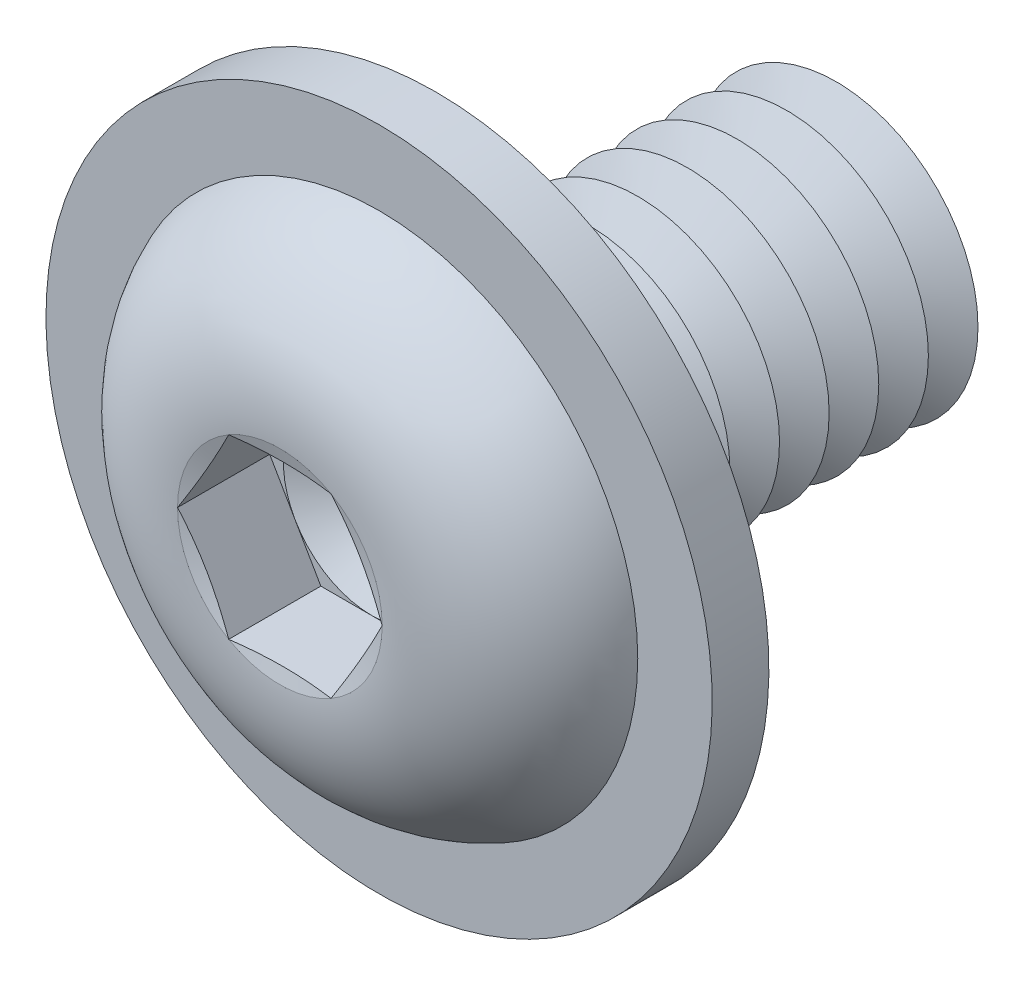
from build123d import *

# Parameters (mm, degrees)
FILLET1_R           = 0.35
LPATTERN1_COUNT     = 8
LPATTERN1_PITCH     = 0.7
CUT_EXTRUDE1_DEPTH  = 1.3
SKETCH5_R           = 4.7
SKETCH5_R_2         = 2.35
BOSS_EXTRUDE1_DEPTH = 0.8


with BuildPart() as part:
    # Sketch1 → Revolve1 (revolve)
    with BuildSketch(Plane(origin=(0, 0, 0), x_dir=(0, 0, -1), z_dir=(1, 0, 0)), mode=Mode.PRIVATE) as revolve1_sk:
        with BuildLine():
            Line((0, 2), (0, 3.8))
            ThreePointArc((0, 3.8), (-1.611961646, 3.099623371), (-2.2, 1.443375))
            Line((-2.2, 1.443375), (-2.006624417, 0.7216875))
            Line((-2.006624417, 0.7216875), (-2.2, 0.7216875))
            Line((-2.2, 0.7216875), (-2.2, 0))
            Line((-2.2, 0), (6, 0))
            Line((6, 0), (6, 2))
            Line((6, 2), (0, 2))
        make_face()
    revolve(revolve1_sk.sketch.rotate(Axis((0, 0, -6), (0, 0, 1)), 90), axis=Axis((0, 0, -6), (0, 0, 1)))

    # Fillet1
    fillet1_edges = [part.edges().sort_by_distance(p)[0] for p in [
        (2, 0, 0),
    ]]
    fillet(fillet1_edges, radius=FILLET1_R)

    # Sketch2 → Cut-Revolve1 (revolve, cut)
    with BuildSketch(Plane(origin=(0, 0, 0), x_dir=(0, 0, -1), z_dir=(1, 0, 0)), mode=Mode.PRIVATE) as cut_revolve1_sk:
        Polygon((5.65, 2), (6.35, 2), (6, 1.393782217), align=None)
    cut_revolve1 = revolve(cut_revolve1_sk.sketch.rotate(Axis((0, 0, -6), (0, 0, -1)), 270), axis=Axis((0, 0, -6), (0, 0, -1)), mode=Mode.SUBTRACT)

    # LPattern1: Cut-Revolve1 ×8
    with Locations(*[(0, 0, i * LPATTERN1_PITCH) for i in range(1, LPATTERN1_COUNT)]):
        add(cut_revolve1, mode=Mode.SUBTRACT)

    # Sketch3 → Cut-Extrude1 (cut)
    with BuildSketch(Plane.XY.offset(2.2)):
        Polygon((0.7216875, 1.249999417), (-0.7216875, 1.249999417), (-1.443375, 0), (-0.7216875, -1.249999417), (0.7216875, -1.249999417), (1.443375, 0), align=None)
    extrude(amount=-CUT_EXTRUDE1_DEPTH, mode=Mode.SUBTRACT)

    # Cut-Extrude2 cone 1 section (on through the dimple's axis) → Cut-Extrude2 (revolve, cut)
    with BuildSketch(Plane(origin=(0, 0, 0.9), x_dir=(0, -1, 0), z_dir=(1, 0, 0))):
        Polygon((0, 0), (1.249999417, 0), (0, 0.7216875), align=None)
    revolve(axis=Axis((0, 0, 0.9), (0, 0, -1)), mode=Mode.SUBTRACT)

    # Sketch5 → Boss-Extrude1 (add)
    with BuildSketch(Plane(origin=(0, 0, 0), x_dir=(-1, 0, 0), z_dir=(0, 0, -1))):
        with Locations(Location((0, 0, 0), (0, 0, 90))):
            Circle(SKETCH5_R)
        Circle(SKETCH5_R_2, mode=Mode.SUBTRACT)
    extrude(amount=-BOSS_EXTRUDE1_DEPTH)


solid = part.part
